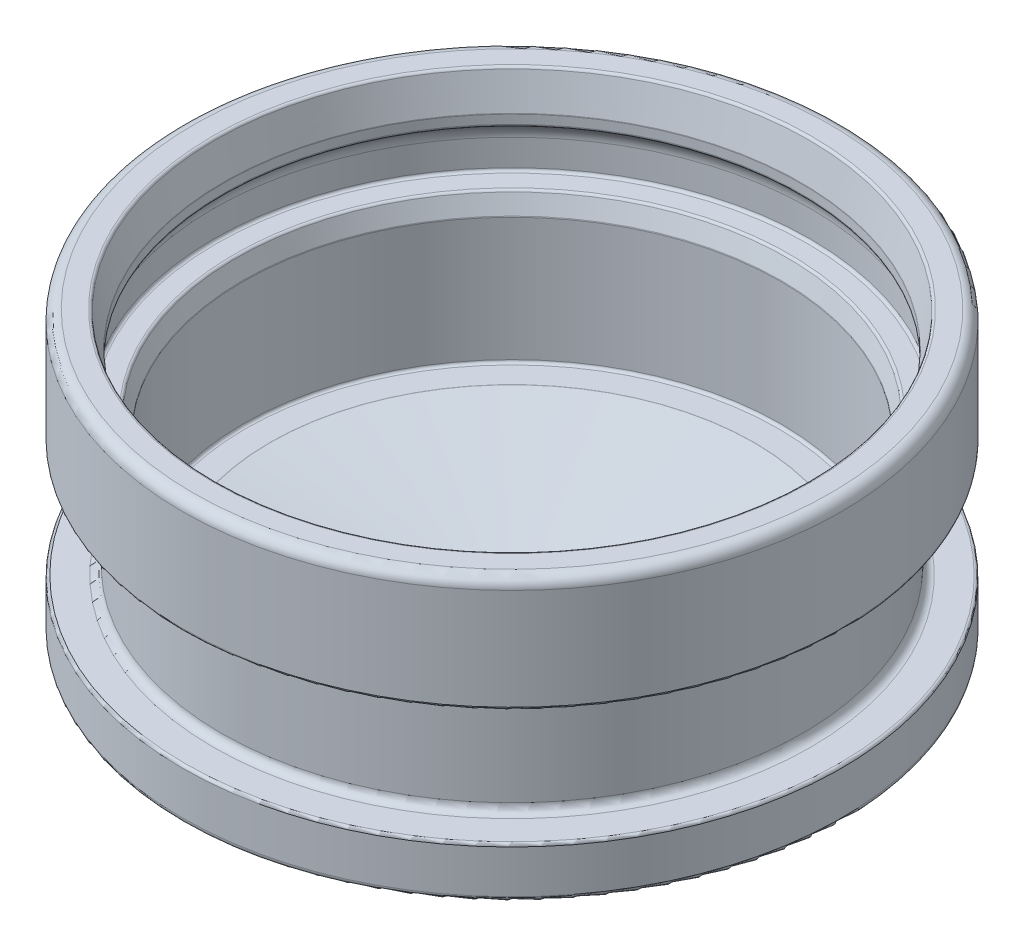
ISO-10303-21;
HEADER;
FILE_DESCRIPTION(('STEP AP214'),'2;1');
FILE_NAME('part.step','',(''),(''),'','','');
FILE_SCHEMA(('AUTOMOTIVE_DESIGN { 1 0 10303 214 1 1 1 1 }'));
ENDSEC;
DATA;
#1=APPLICATION_CONTEXT('core data for automotive mechanical design processes');
#2=APPLICATION_PROTOCOL_DEFINITION('international standard','automotive_design',2000,#1);
#3=PRODUCT_CONTEXT('',#1,'mechanical');
#4=PRODUCT('Part','Part','',(#3));
#5=PRODUCT_RELATED_PRODUCT_CATEGORY('part','',(#4));
#6=PRODUCT_DEFINITION_FORMATION('','',#4);
#7=PRODUCT_DEFINITION_CONTEXT('part definition',#1,'design');
#8=PRODUCT_DEFINITION('design','',#6,#7);
#9=PRODUCT_DEFINITION_SHAPE('','',#8);
#10=(LENGTH_UNIT() NAMED_UNIT(*) SI_UNIT(.MILLI.,.METRE.));
#11=(NAMED_UNIT(*) PLANE_ANGLE_UNIT() SI_UNIT($,.RADIAN.));
#12=(NAMED_UNIT(*) SI_UNIT($,.STERADIAN.) SOLID_ANGLE_UNIT());
#13=UNCERTAINTY_MEASURE_WITH_UNIT(LENGTH_MEASURE(1.E-05),#10,'distance_accuracy_value','');
#14=(GEOMETRIC_REPRESENTATION_CONTEXT(3) GLOBAL_UNCERTAINTY_ASSIGNED_CONTEXT((#13)) GLOBAL_UNIT_ASSIGNED_CONTEXT((#10,
#11,#12)) REPRESENTATION_CONTEXT('',''));
#15=CARTESIAN_POINT('',(0.,0.,0.));
#16=DIRECTION('',(0.,0.,1.));
#17=DIRECTION('',(1.,0.,0.));
#18=AXIS2_PLACEMENT_3D('',#15,#16,#17);
#19=CARTESIAN_POINT('',(0.,-0.508000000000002,0.));
#20=DIRECTION('',(0.,1.,0.));
#21=DIRECTION('',(0.,0.,1.00000000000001));
#22=AXIS2_PLACEMENT_3D('',#19,#20,#21);
#23=TOROIDAL_SURFACE('',#22,15.0495,0.508);
#24=CARTESIAN_POINT('',(0.,-0.508000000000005,0.));
#25=DIRECTION('',(0.,1.,0.));
#26=DIRECTION('',(0.,0.,1.00000000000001));
#27=AXIS2_PLACEMENT_3D('',#24,#25,#26);
#28=CIRCLE('',#27,15.5575);
#29=CARTESIAN_POINT('',(0.,-0.508000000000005,15.5575000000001));
#30=VERTEX_POINT('',#29);
#31=EDGE_CURVE('E10',#30,#30,#28,.T.);
#32=ORIENTED_EDGE('',*,*,#31,.T.);
#33=EDGE_LOOP('',(#32));
#34=FACE_BOUND('',#33,.T.);
#35=CARTESIAN_POINT('',(0.,0.,0.));
#36=DIRECTION('',(0.,1.,0.));
#37=DIRECTION('',(0.,0.,1.00000000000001));
#38=AXIS2_PLACEMENT_3D('',#35,#36,#37);
#39=CIRCLE('',#38,15.0495);
#40=CARTESIAN_POINT('',(0.,0.,15.0495000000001));
#41=VERTEX_POINT('',#40);
#42=EDGE_CURVE('E135',#41,#41,#39,.T.);
#43=ORIENTED_EDGE('',*,*,#42,.F.);
#44=EDGE_LOOP('',(#43));
#45=FACE_BOUND('',#44,.T.);
#46=ADVANCED_FACE('F32',(#34,#45),#23,.T.);
#47=CARTESIAN_POINT('',(0.,0.,0.));
#48=DIRECTION('',(0.,1.,0.));
#49=DIRECTION('',(0.,0.,1.00000000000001));
#50=AXIS2_PLACEMENT_3D('',#47,#48,#49);
#51=CYLINDRICAL_SURFACE('',#50,15.5575);
#52=CARTESIAN_POINT('',(0.,-5.2832,0.));
#53=DIRECTION('',(0.,1.,0.));
#54=DIRECTION('',(0.,0.,1.00000000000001));
#55=AXIS2_PLACEMENT_3D('',#52,#53,#54);
#56=CIRCLE('',#55,15.5575);
#57=CARTESIAN_POINT('',(0.,-5.2832,15.5575000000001));
#58=VERTEX_POINT('',#57);
#59=EDGE_CURVE('E38',#58,#58,#56,.T.);
#60=ORIENTED_EDGE('',*,*,#59,.T.);
#61=EDGE_LOOP('',(#60));
#62=FACE_BOUND('',#61,.T.);
#63=ORIENTED_EDGE('',*,*,#31,.F.);
#64=EDGE_LOOP('',(#63));
#65=FACE_BOUND('',#64,.T.);
#66=ADVANCED_FACE('F143',(#62,#65),#51,.T.);
#67=CARTESIAN_POINT('',(0.,-5.2832,0.));
#68=DIRECTION('',(0.,1.,0.));
#69=DIRECTION('',(0.,0.,1.00000000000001));
#70=AXIS2_PLACEMENT_3D('',#67,#68,#69);
#71=TOROIDAL_SURFACE('',#70,15.4305,0.127);
#72=CARTESIAN_POINT('',(0.,-5.4102,0.));
#73=DIRECTION('',(0.,1.,0.));
#74=DIRECTION('',(0.,0.,1.00000000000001));
#75=AXIS2_PLACEMENT_3D('',#72,#73,#74);
#76=CIRCLE('',#75,15.4305);
#77=CARTESIAN_POINT('',(0.,-5.4102,15.4305000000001));
#78=VERTEX_POINT('',#77);
#79=EDGE_CURVE('E42',#78,#78,#76,.T.);
#80=ORIENTED_EDGE('',*,*,#79,.T.);
#81=EDGE_LOOP('',(#80));
#82=FACE_BOUND('',#81,.T.);
#83=ORIENTED_EDGE('',*,*,#59,.F.);
#84=EDGE_LOOP('',(#83));
#85=FACE_BOUND('',#84,.T.);
#86=ADVANCED_FACE('F147',(#82,#85),#71,.T.);
#87=CARTESIAN_POINT('',(-15.4305000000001,-5.4102,0.));
#88=DIRECTION('',(0.,-1.,0.));
#89=DIRECTION('',(0.,0.,-1.00000000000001));
#90=AXIS2_PLACEMENT_3D('',#87,#88,#89);
#91=PLANE('',#90);
#92=CARTESIAN_POINT('',(0.,-5.4102,0.));
#93=DIRECTION('',(0.,1.,0.));
#94=DIRECTION('',(0.,0.,1.00000000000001));
#95=AXIS2_PLACEMENT_3D('',#92,#93,#94);
#96=CIRCLE('',#95,14.097);
#97=CARTESIAN_POINT('',(0.,-5.4102,14.0970000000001));
#98=VERTEX_POINT('',#97);
#99=EDGE_CURVE('E46',#98,#98,#96,.T.);
#100=ORIENTED_EDGE('',*,*,#99,.T.);
#101=EDGE_LOOP('',(#100));
#102=FACE_BOUND('',#101,.T.);
#103=ORIENTED_EDGE('',*,*,#79,.F.);
#104=EDGE_LOOP('',(#103));
#105=FACE_BOUND('',#104,.T.);
#106=ADVANCED_FACE('F151',(#102,#105),#91,.T.);
#107=CARTESIAN_POINT('',(0.,-5.7912,0.));
#108=DIRECTION('',(0.,1.,0.));
#109=DIRECTION('',(0.,0.,1.00000000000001));
#110=AXIS2_PLACEMENT_3D('',#107,#108,#109);
#111=TOROIDAL_SURFACE('',#110,14.097,0.381);
#112=CARTESIAN_POINT('',(0.,-5.7912,0.));
#113=DIRECTION('',(0.,1.,0.));
#114=DIRECTION('',(0.,0.,1.00000000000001));
#115=AXIS2_PLACEMENT_3D('',#112,#113,#114);
#116=CIRCLE('',#115,13.716);
#117=CARTESIAN_POINT('',(0.,-5.7912,13.7160000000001));
#118=VERTEX_POINT('',#117);
#119=EDGE_CURVE('E51',#118,#118,#116,.T.);
#120=ORIENTED_EDGE('',*,*,#119,.T.);
#121=EDGE_LOOP('',(#120));
#122=FACE_BOUND('',#121,.T.);
#123=ORIENTED_EDGE('',*,*,#99,.F.);
#124=EDGE_LOOP('',(#123));
#125=FACE_BOUND('',#124,.T.);
#126=ADVANCED_FACE('F158',(#122,#125),#111,.F.);
#127=CARTESIAN_POINT('',(0.,0.,0.));
#128=DIRECTION('',(0.,1.,0.));
#129=DIRECTION('',(0.,0.,1.00000000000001));
#130=AXIS2_PLACEMENT_3D('',#127,#128,#129);
#131=CYLINDRICAL_SURFACE('',#130,13.716);
#132=CARTESIAN_POINT('',(0.,-10.4902,0.));
#133=DIRECTION('',(0.,1.,0.));
#134=DIRECTION('',(0.,0.,1.00000000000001));
#135=AXIS2_PLACEMENT_3D('',#132,#133,#134);
#136=CIRCLE('',#135,13.716);
#137=CARTESIAN_POINT('',(0.,-10.4902,13.7160000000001));
#138=VERTEX_POINT('',#137);
#139=EDGE_CURVE('E54',#138,#138,#136,.T.);
#140=ORIENTED_EDGE('',*,*,#139,.T.);
#141=EDGE_LOOP('',(#140));
#142=FACE_BOUND('',#141,.T.);
#143=ORIENTED_EDGE('',*,*,#119,.F.);
#144=EDGE_LOOP('',(#143));
#145=FACE_BOUND('',#144,.T.);
#146=ADVANCED_FACE('F162',(#142,#145),#131,.T.);
#147=CARTESIAN_POINT('',(0.,-10.4902,0.));
#148=DIRECTION('',(0.,1.,0.));
#149=DIRECTION('',(0.,0.,1.00000000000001));
#150=AXIS2_PLACEMENT_3D('',#147,#148,#149);
#151=TOROIDAL_SURFACE('',#150,14.097,0.380999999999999);
#152=CARTESIAN_POINT('',(0.,-10.8712,0.));
#153=DIRECTION('',(0.,1.,0.));
#154=DIRECTION('',(0.,0.,1.00000000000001));
#155=AXIS2_PLACEMENT_3D('',#152,#153,#154);
#156=CIRCLE('',#155,14.097);
#157=CARTESIAN_POINT('',(0.,-10.8712,14.0970000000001));
#158=VERTEX_POINT('',#157);
#159=EDGE_CURVE('E57',#158,#158,#156,.T.);
#160=ORIENTED_EDGE('',*,*,#159,.T.);
#161=EDGE_LOOP('',(#160));
#162=FACE_BOUND('',#161,.T.);
#163=ORIENTED_EDGE('',*,*,#139,.F.);
#164=EDGE_LOOP('',(#163));
#165=FACE_BOUND('',#164,.T.);
#166=ADVANCED_FACE('F166',(#162,#165),#151,.F.);
#167=CARTESIAN_POINT('',(-14.0970000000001,-10.8712,0.));
#168=DIRECTION('',(0.,1.,0.));
#169=DIRECTION('',(0.,0.,1.00000000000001));
#170=AXIS2_PLACEMENT_3D('',#167,#168,#169);
#171=PLANE('',#170);
#172=CARTESIAN_POINT('',(0.,-10.8712,0.));
#173=DIRECTION('',(0.,1.,0.));
#174=DIRECTION('',(0.,0.,1.00000000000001));
#175=AXIS2_PLACEMENT_3D('',#172,#173,#174);
#176=CIRCLE('',#175,15.4305);
#177=CARTESIAN_POINT('',(0.,-10.8712,15.4305000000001));
#178=VERTEX_POINT('',#177);
#179=EDGE_CURVE('E60',#178,#178,#176,.T.);
#180=ORIENTED_EDGE('',*,*,#179,.T.);
#181=EDGE_LOOP('',(#180));
#182=FACE_BOUND('',#181,.T.);
#183=ORIENTED_EDGE('',*,*,#159,.F.);
#184=EDGE_LOOP('',(#183));
#185=FACE_BOUND('',#184,.T.);
#186=ADVANCED_FACE('F170',(#182,#185),#171,.T.);
#187=CARTESIAN_POINT('',(0.,-10.9982,0.));
#188=DIRECTION('',(0.,1.,0.));
#189=DIRECTION('',(0.,0.,1.00000000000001));
#190=AXIS2_PLACEMENT_3D('',#187,#188,#189);
#191=TOROIDAL_SURFACE('',#190,15.4305,0.127000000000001);
#192=CARTESIAN_POINT('',(0.,-10.9982,0.));
#193=DIRECTION('',(0.,1.,0.));
#194=DIRECTION('',(0.,0.,1.00000000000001));
#195=AXIS2_PLACEMENT_3D('',#192,#193,#194);
#196=CIRCLE('',#195,15.5575);
#197=CARTESIAN_POINT('',(0.,-10.9982,15.5575000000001));
#198=VERTEX_POINT('',#197);
#199=EDGE_CURVE('E63',#198,#198,#196,.T.);
#200=ORIENTED_EDGE('',*,*,#199,.T.);
#201=EDGE_LOOP('',(#200));
#202=FACE_BOUND('',#201,.T.);
#203=ORIENTED_EDGE('',*,*,#179,.F.);
#204=EDGE_LOOP('',(#203));
#205=FACE_BOUND('',#204,.T.);
#206=ADVANCED_FACE('F174',(#202,#205),#191,.T.);
#207=CARTESIAN_POINT('',(0.,0.,0.));
#208=DIRECTION('',(0.,1.,0.));
#209=DIRECTION('',(0.,0.,1.00000000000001));
#210=AXIS2_PLACEMENT_3D('',#207,#208,#209);
#211=CYLINDRICAL_SURFACE('',#210,15.5575);
#212=CARTESIAN_POINT('',(0.,-13.0302,0.));
#213=DIRECTION('',(0.,1.,0.));
#214=DIRECTION('',(0.,0.,1.00000000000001));
#215=AXIS2_PLACEMENT_3D('',#212,#213,#214);
#216=CIRCLE('',#215,15.5575);
#217=CARTESIAN_POINT('',(0.,-13.0302,15.5575000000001));
#218=VERTEX_POINT('',#217);
#219=EDGE_CURVE('E66',#218,#218,#216,.T.);
#220=ORIENTED_EDGE('',*,*,#219,.T.);
#221=EDGE_LOOP('',(#220));
#222=FACE_BOUND('',#221,.T.);
#223=ORIENTED_EDGE('',*,*,#199,.F.);
#224=EDGE_LOOP('',(#223));
#225=FACE_BOUND('',#224,.T.);
#226=ADVANCED_FACE('F178',(#222,#225),#211,.T.);
#227=CARTESIAN_POINT('',(0.,-13.0302,0.));
#228=DIRECTION('',(0.,1.,0.));
#229=DIRECTION('',(0.,0.,1.00000000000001));
#230=AXIS2_PLACEMENT_3D('',#227,#228,#229);
#231=TOROIDAL_SURFACE('',#230,15.3035,0.254000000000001);
#232=CARTESIAN_POINT('',(0.,-13.2842,0.));
#233=DIRECTION('',(0.,1.,0.));
#234=DIRECTION('',(0.,0.,1.00000000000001));
#235=AXIS2_PLACEMENT_3D('',#232,#233,#234);
#236=CIRCLE('',#235,15.3035);
#237=CARTESIAN_POINT('',(0.,-13.2842,15.3035000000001));
#238=VERTEX_POINT('',#237);
#239=EDGE_CURVE('E69',#238,#238,#236,.T.);
#240=ORIENTED_EDGE('',*,*,#239,.T.);
#241=EDGE_LOOP('',(#240));
#242=FACE_BOUND('',#241,.T.);
#243=ORIENTED_EDGE('',*,*,#219,.F.);
#244=EDGE_LOOP('',(#243));
#245=FACE_BOUND('',#244,.T.);
#246=ADVANCED_FACE('F182',(#242,#245),#231,.T.);
#247=CARTESIAN_POINT('',(-15.3035000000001,-13.2842,0.));
#248=DIRECTION('',(0.,-1.,0.));
#249=DIRECTION('',(0.,0.,-1.00000000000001));
#250=AXIS2_PLACEMENT_3D('',#247,#248,#249);
#251=PLANE('',#250);
#252=CARTESIAN_POINT('',(0.,-13.2842,0.));
#253=DIRECTION('',(0.,1.,0.));
#254=DIRECTION('',(0.,0.,1.00000000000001));
#255=AXIS2_PLACEMENT_3D('',#252,#253,#254);
#256=CIRCLE('',#255,1.8034);
#257=CARTESIAN_POINT('',(0.,-13.2842,1.80340000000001));
#258=VERTEX_POINT('',#257);
#259=EDGE_CURVE('E72',#258,#258,#256,.T.);
#260=ORIENTED_EDGE('',*,*,#259,.T.);
#261=EDGE_LOOP('',(#260));
#262=FACE_BOUND('',#261,.T.);
#263=ORIENTED_EDGE('',*,*,#239,.F.);
#264=EDGE_LOOP('',(#263));
#265=FACE_BOUND('',#264,.T.);
#266=ADVANCED_FACE('F186',(#262,#265),#251,.T.);
#267=CARTESIAN_POINT('',(0.,-13.208,0.));
#268=DIRECTION('',(0.,1.,0.));
#269=DIRECTION('',(0.,0.,1.00000000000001));
#270=AXIS2_PLACEMENT_3D('',#267,#268,#269);
#271=TOROIDAL_SURFACE('',#270,1.8034,0.0762000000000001);
#272=CARTESIAN_POINT('',(0.,-13.208,0.));
#273=DIRECTION('',(0.,1.,0.));
#274=DIRECTION('',(0.,0.,1.00000000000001));
#275=AXIS2_PLACEMENT_3D('',#272,#273,#274);
#276=CIRCLE('',#275,1.7272);
#277=CARTESIAN_POINT('',(0.,-13.208,1.72720000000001));
#278=VERTEX_POINT('',#277);
#279=EDGE_CURVE('E75',#278,#278,#276,.T.);
#280=ORIENTED_EDGE('',*,*,#279,.T.);
#281=EDGE_LOOP('',(#280));
#282=FACE_BOUND('',#281,.T.);
#283=ORIENTED_EDGE('',*,*,#259,.F.);
#284=EDGE_LOOP('',(#283));
#285=FACE_BOUND('',#284,.T.);
#286=ADVANCED_FACE('F190',(#282,#285),#271,.T.);
#287=CARTESIAN_POINT('',(0.,0.,0.));
#288=DIRECTION('',(0.,1.,0.));
#289=DIRECTION('',(0.,0.,1.00000000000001));
#290=AXIS2_PLACEMENT_3D('',#287,#288,#289);
#291=CYLINDRICAL_SURFACE('',#290,1.7272);
#292=CARTESIAN_POINT('',(0.,-12.9670334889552,0.));
#293=DIRECTION('',(0.,1.,0.));
#294=DIRECTION('',(0.,0.,1.00000000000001));
#295=AXIS2_PLACEMENT_3D('',#292,#293,#294);
#296=CIRCLE('',#295,1.7272);
#297=CARTESIAN_POINT('',(0.,-12.9670334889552,1.72720000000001));
#298=VERTEX_POINT('',#297);
#299=EDGE_CURVE('E78',#298,#298,#296,.T.);
#300=ORIENTED_EDGE('',*,*,#299,.T.);
#301=EDGE_LOOP('',(#300));
#302=FACE_BOUND('',#301,.T.);
#303=ORIENTED_EDGE('',*,*,#279,.F.);
#304=EDGE_LOOP('',(#303));
#305=FACE_BOUND('',#304,.T.);
#306=ADVANCED_FACE('F194',(#302,#305),#291,.F.);
#307=CARTESIAN_POINT('',(0.,-12.9670334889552,0.));
#308=DIRECTION('',(0.,1.,0.));
#309=DIRECTION('',(0.,0.,1.00000000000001));
#310=AXIS2_PLACEMENT_3D('',#307,#308,#309);
#311=TOROIDAL_SURFACE('',#310,1.8034,0.0761999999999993);
#312=CARTESIAN_POINT('',(0.,-12.8920128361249,0.));
#313=DIRECTION('',(0.,1.,0.));
#314=DIRECTION('',(0.,0.,1.00000000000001));
#315=AXIS2_PLACEMENT_3D('',#312,#313,#314);
#316=CIRCLE('',#315,1.79004553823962);
#317=CARTESIAN_POINT('',(0.,-12.8920128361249,1.79004553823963));
#318=VERTEX_POINT('',#317);
#319=EDGE_CURVE('E81',#318,#318,#316,.T.);
#320=ORIENTED_EDGE('',*,*,#319,.T.);
#321=EDGE_LOOP('',(#320));
#322=FACE_BOUND('',#321,.T.);
#323=ORIENTED_EDGE('',*,*,#299,.F.);
#324=EDGE_LOOP('',(#323));
#325=FACE_BOUND('',#324,.T.);
#326=ADVANCED_FACE('F198',(#322,#325),#311,.T.);
#327=CARTESIAN_POINT('',(0.,-12.8920128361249,0.));
#328=DIRECTION('',(0.,1.,0.));
#329=DIRECTION('',(0.,0.,1.00000000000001));
#330=AXIS2_PLACEMENT_3D('',#327,#328,#329);
#331=CONICAL_SURFACE('',#330,1.79004553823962,1.39463114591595);
#332=CARTESIAN_POINT('',(0.,-11.1771793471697,0.));
#333=DIRECTION('',(0.,1.,0.));
#334=DIRECTION('',(0.,0.,1.00000000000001));
#335=AXIS2_PLACEMENT_3D('',#332,#333,#334);
#336=CIRCLE('',#335,11.423374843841);
#337=CARTESIAN_POINT('',(0.,-11.1771793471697,11.4233748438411));
#338=VERTEX_POINT('',#337);
#339=EDGE_CURVE('E84',#338,#338,#336,.T.);
#340=CARTESIAN_POINT('',(0.,-11.1771793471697,11.4233748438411));
#341=CARTESIAN_POINT('',(0.,-11.1950421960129,11.3230276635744));
#342=CARTESIAN_POINT('',(0.,-11.2129050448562,11.2226804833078));
#343=CARTESIAN_POINT('',(0.,-11.2486307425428,11.0219861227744));
#344=CARTESIAN_POINT('',(0.,-11.2664935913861,10.9216389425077));
#345=CARTESIAN_POINT('',(0.,-11.3022192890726,10.7209445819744));
#346=CARTESIAN_POINT('',(0.,-11.3200821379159,10.6205974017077));
#347=CARTESIAN_POINT('',(0.,-11.3558078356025,10.4199030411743));
#348=CARTESIAN_POINT('',(0.,-11.3736706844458,10.3195558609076));
#349=CARTESIAN_POINT('',(0.,-11.4093963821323,10.1188615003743));
#350=CARTESIAN_POINT('',(0.,-11.4272592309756,10.0185143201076));
#351=CARTESIAN_POINT('',(0.,-11.4629849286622,9.81781995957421));
#352=CARTESIAN_POINT('',(0.,-11.4808477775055,9.71747277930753));
#353=CARTESIAN_POINT('',(0.,-11.516573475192,9.51677841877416));
#354=CARTESIAN_POINT('',(0.,-11.5344363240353,9.41643123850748));
#355=CARTESIAN_POINT('',(0.,-11.5701620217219,9.21573687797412));
#356=CARTESIAN_POINT('',(0.,-11.5880248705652,9.11538969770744));
#357=CARTESIAN_POINT('',(0.,-11.6237505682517,8.91469533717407));
#358=CARTESIAN_POINT('',(0.,-11.641613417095,8.81434815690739));
#359=CARTESIAN_POINT('',(0.,-11.6773391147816,8.61365379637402));
#360=CARTESIAN_POINT('',(0.,-11.6952019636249,8.51330661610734));
#361=CARTESIAN_POINT('',(0.,-11.7309276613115,8.31261225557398));
#362=CARTESIAN_POINT('',(0.,-11.7487905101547,8.21226507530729));
#363=CARTESIAN_POINT('',(0.,-11.7845162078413,8.01157071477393));
#364=CARTESIAN_POINT('',(0.,-11.8023790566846,7.91122353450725));
#365=CARTESIAN_POINT('',(0.,-11.8381047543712,7.71052917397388));
#366=CARTESIAN_POINT('',(0.,-11.8559676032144,7.6101819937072));
#367=CARTESIAN_POINT('',(0.,-11.891693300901,7.40948763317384));
#368=CARTESIAN_POINT('',(0.,-11.9095561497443,7.30914045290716));
#369=CARTESIAN_POINT('',(0.,-11.9452818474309,7.10844609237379));
#370=CARTESIAN_POINT('',(0.,-11.9631446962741,7.00809891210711));
#371=CARTESIAN_POINT('',(0.,-11.9988703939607,6.80740455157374));
#372=CARTESIAN_POINT('',(0.,-12.016733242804,6.70705737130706));
#373=CARTESIAN_POINT('',(0.,-12.0524589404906,6.5063630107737));
#374=CARTESIAN_POINT('',(0.,-12.0703217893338,6.40601583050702));
#375=CARTESIAN_POINT('',(0.,-12.1060474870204,6.20532146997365));
#376=CARTESIAN_POINT('',(0.,-12.1239103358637,6.10497428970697));
#377=CARTESIAN_POINT('',(0.,-12.1596360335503,5.9042799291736));
#378=CARTESIAN_POINT('',(0.,-12.1774988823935,5.80393274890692));
#379=CARTESIAN_POINT('',(0.,-12.2132245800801,5.60323838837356));
#380=CARTESIAN_POINT('',(0.,-12.2310874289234,5.50289120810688));
#381=CARTESIAN_POINT('',(0.,-12.26681312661,5.30219684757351));
#382=CARTESIAN_POINT('',(0.,-12.2846759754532,5.20184966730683));
#383=CARTESIAN_POINT('',(0.,-12.3204016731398,5.00115530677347));
#384=CARTESIAN_POINT('',(0.,-12.3382645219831,4.90080812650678));
#385=CARTESIAN_POINT('',(0.,-12.3739902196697,4.70011376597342));
#386=CARTESIAN_POINT('',(0.,-12.3918530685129,4.59976658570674));
#387=CARTESIAN_POINT('',(0.,-12.4275787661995,4.39907222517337));
#388=CARTESIAN_POINT('',(0.,-12.4454416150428,4.29872504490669));
#389=CARTESIAN_POINT('',(0.,-12.4811673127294,4.09803068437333));
#390=CARTESIAN_POINT('',(0.,-12.4990301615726,3.99768350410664));
#391=CARTESIAN_POINT('',(0.,-12.5347558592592,3.79698914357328));
#392=CARTESIAN_POINT('',(0.,-12.5526187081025,3.6966419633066));
#393=CARTESIAN_POINT('',(0.,-12.5883444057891,3.49594760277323));
#394=CARTESIAN_POINT('',(0.,-12.6062072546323,3.39560042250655));
#395=CARTESIAN_POINT('',(0.,-12.6419329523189,3.19490606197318));
#396=CARTESIAN_POINT('',(0.,-12.6597958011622,3.0945588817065));
#397=CARTESIAN_POINT('',(0.,-12.6955214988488,2.89386452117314));
#398=CARTESIAN_POINT('',(0.,-12.713384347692,2.79351734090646));
#399=CARTESIAN_POINT('',(0.,-12.7491100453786,2.59282298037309));
#400=CARTESIAN_POINT('',(0.,-12.7669728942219,2.49247580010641));
#401=CARTESIAN_POINT('',(0.,-12.8026985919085,2.29178143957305));
#402=CARTESIAN_POINT('',(0.,-12.8205614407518,2.19143425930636));
#403=CARTESIAN_POINT('',(0.,-12.8562871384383,1.990739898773));
#404=CARTESIAN_POINT('',(0.,-12.8741499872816,1.89039271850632));
#405=CARTESIAN_POINT('',(0.,-12.8920128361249,1.79004553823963));
#406=B_SPLINE_CURVE_WITH_KNOTS('',3,(#340,#341,#342,#343,#344,#345,#346,#347,#348,#349,#350,
#351,#352,#353,#354,#355,#356,#357,#358,#359,#360,#361,#362,#363,#364,#365,#366,#367,#368,#369,
#370,#371,#372,#373,#374,#375,#376,#377,#378,#379,#380,#381,#382,#383,#384,#385,#386,#387,#388,
#389,#390,#391,#392,#393,#394,#395,#396,#397,#398,#399,#400,#401,#402,#403,#404,#405),
.UNSPECIFIED.,.F.,.F.,(4,2,2,2,2,2,2,2,2,2,2,2,2,2,2,2,2,2,2,2,2,2,2,2,2,2,2,2,2,2,2,2,4),(0.,
0.305774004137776,0.611548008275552,0.917322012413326,1.2230960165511,1.52887002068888,
1.83464402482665,2.14041802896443,2.4461920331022,2.75196603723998,3.05774004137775,
3.36351404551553,3.6692880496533,3.97506205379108,4.28083605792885,4.58661006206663,
4.8923840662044,5.19815807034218,5.50393207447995,5.80970607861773,6.1154800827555,
6.42125408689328,6.72702809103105,7.03280209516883,7.33857609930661,7.64435010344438,
7.95012410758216,8.25589811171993,8.56167211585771,8.86744611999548,9.17322012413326,
9.47899412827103,9.78476813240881),.UNSPECIFIED.);
#407=EDGE_CURVE('BSEAM202',#338,#318,#406,.T.);
#408=ORIENTED_EDGE('',*,*,#339,.T.);
#409=ORIENTED_EDGE('',*,*,#319,.F.);
#410=ORIENTED_EDGE('',*,*,#407,.T.);
#411=ORIENTED_EDGE('',*,*,#407,.F.);
#412=EDGE_LOOP('',(#408,#410,#409,#411));
#413=FACE_BOUND('',#412,.T.);
#414=ADVANCED_FACE('F202',(#413),#331,.F.);
#415=CARTESIAN_POINT('',(0.,-11.2522,0.));
#416=DIRECTION('',(0.,1.,0.));
#417=DIRECTION('',(0.,0.,1.00000000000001));
#418=AXIS2_PLACEMENT_3D('',#415,#416,#417);
#419=TOROIDAL_SURFACE('',#418,11.4367293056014,0.0762000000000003);
#420=CARTESIAN_POINT('',(0.,-11.176,0.));
#421=DIRECTION('',(0.,1.,0.));
#422=DIRECTION('',(0.,0.,1.00000000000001));
#423=AXIS2_PLACEMENT_3D('',#420,#421,#422);
#424=CIRCLE('',#423,11.4367293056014);
#425=CARTESIAN_POINT('',(0.,-11.176,11.4367293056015));
#426=VERTEX_POINT('',#425);
#427=EDGE_CURVE('E87',#426,#426,#424,.T.);
#428=ORIENTED_EDGE('',*,*,#427,.T.);
#429=EDGE_LOOP('',(#428));
#430=FACE_BOUND('',#429,.T.);
#431=ORIENTED_EDGE('',*,*,#339,.F.);
#432=EDGE_LOOP('',(#431));
#433=FACE_BOUND('',#432,.T.);
#434=ADVANCED_FACE('F206',(#430,#433),#419,.T.);
#435=CARTESIAN_POINT('',(-11.4367293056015,-11.176,0.));
#436=DIRECTION('',(0.,1.,0.));
#437=DIRECTION('',(0.,0.,1.00000000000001));
#438=AXIS2_PLACEMENT_3D('',#435,#436,#437);
#439=PLANE('',#438);
#440=CARTESIAN_POINT('',(0.,-11.176,0.));
#441=DIRECTION('',(0.,1.,0.));
#442=DIRECTION('',(0.,0.,1.00000000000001));
#443=AXIS2_PLACEMENT_3D('',#440,#441,#442);
#444=CIRCLE('',#443,12.573);
#445=CARTESIAN_POINT('',(0.,-11.176,12.5730000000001));
#446=VERTEX_POINT('',#445);
#447=EDGE_CURVE('E90',#446,#446,#444,.T.);
#448=ORIENTED_EDGE('',*,*,#447,.T.);
#449=EDGE_LOOP('',(#448));
#450=FACE_BOUND('',#449,.T.);
#451=ORIENTED_EDGE('',*,*,#427,.F.);
#452=EDGE_LOOP('',(#451));
#453=FACE_BOUND('',#452,.T.);
#454=ADVANCED_FACE('F210',(#450,#453),#439,.T.);
#455=CARTESIAN_POINT('',(0.,-11.049,0.));
#456=DIRECTION('',(0.,1.,0.));
#457=DIRECTION('',(0.,0.,1.00000000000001));
#458=AXIS2_PLACEMENT_3D('',#455,#456,#457);
#459=TOROIDAL_SURFACE('',#458,12.573,0.127);
#460=CARTESIAN_POINT('',(0.,-11.049,0.));
#461=DIRECTION('',(0.,1.,0.));
#462=DIRECTION('',(0.,0.,1.00000000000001));
#463=AXIS2_PLACEMENT_3D('',#460,#461,#462);
#464=CIRCLE('',#463,12.7);
#465=CARTESIAN_POINT('',(0.,-11.049,12.7000000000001));
#466=VERTEX_POINT('',#465);
#467=EDGE_CURVE('E93',#466,#466,#464,.T.);
#468=ORIENTED_EDGE('',*,*,#467,.T.);
#469=EDGE_LOOP('',(#468));
#470=FACE_BOUND('',#469,.T.);
#471=ORIENTED_EDGE('',*,*,#447,.F.);
#472=EDGE_LOOP('',(#471));
#473=FACE_BOUND('',#472,.T.);
#474=ADVANCED_FACE('F214',(#470,#473),#459,.F.);
#475=CARTESIAN_POINT('',(0.,0.,0.));
#476=DIRECTION('',(0.,1.,0.));
#477=DIRECTION('',(0.,0.,1.00000000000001));
#478=AXIS2_PLACEMENT_3D('',#475,#476,#477);
#479=CYLINDRICAL_SURFACE('',#478,12.7);
#480=CARTESIAN_POINT('',(0.,-5.22939352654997,0.));
#481=DIRECTION('',(0.,1.,0.));
#482=DIRECTION('',(0.,0.,1.00000000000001));
#483=AXIS2_PLACEMENT_3D('',#480,#481,#482);
#484=CIRCLE('',#483,12.7);
#485=CARTESIAN_POINT('',(0.,-5.22939352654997,12.7000000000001));
#486=VERTEX_POINT('',#485);
#487=EDGE_CURVE('E96',#486,#486,#484,.T.);
#488=ORIENTED_EDGE('',*,*,#487,.T.);
#489=EDGE_LOOP('',(#488));
#490=FACE_BOUND('',#489,.T.);
#491=ORIENTED_EDGE('',*,*,#467,.F.);
#492=EDGE_LOOP('',(#491));
#493=FACE_BOUND('',#492,.T.);
#494=ADVANCED_FACE('F218',(#490,#493),#479,.F.);
#495=CARTESIAN_POINT('',(0.,-5.22939352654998,0.));
#496=DIRECTION('',(0.,1.,0.));
#497=DIRECTION('',(0.,0.,1.00000000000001));
#498=AXIS2_PLACEMENT_3D('',#495,#496,#497);
#499=TOROIDAL_SURFACE('',#498,12.827,0.127);
#500=CARTESIAN_POINT('',(0.,-5.18595696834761,0.));
#501=DIRECTION('',(0.,1.,0.));
#502=DIRECTION('',(0.,0.,1.00000000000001));
#503=AXIS2_PLACEMENT_3D('',#500,#501,#502);
#504=CIRCLE('',#503,12.7076590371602);
#505=CARTESIAN_POINT('',(0.,-5.18595696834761,12.7076590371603));
#506=VERTEX_POINT('',#505);
#507=EDGE_CURVE('E99',#506,#506,#504,.T.);
#508=ORIENTED_EDGE('',*,*,#507,.T.);
#509=EDGE_LOOP('',(#508));
#510=FACE_BOUND('',#509,.T.);
#511=ORIENTED_EDGE('',*,*,#487,.F.);
#512=EDGE_LOOP('',(#511));
#513=FACE_BOUND('',#512,.T.);
#514=ADVANCED_FACE('F222',(#510,#513),#499,.T.);
#515=CARTESIAN_POINT('',(0.,-5.18595696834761,0.));
#516=DIRECTION('',(0.,1.,0.));
#517=DIRECTION('',(0.,0.,1.00000000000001));
#518=AXIS2_PLACEMENT_3D('',#515,#516,#517);
#519=CONICAL_SURFACE('',#518,12.7076590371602,0.34906585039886);
#520=CARTESIAN_POINT('',(0.,-4.40156344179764,0.));
#521=DIRECTION('',(0.,1.,0.));
#522=DIRECTION('',(0.,0.,1.00000000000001));
#523=AXIS2_PLACEMENT_3D('',#520,#521,#522);
#524=CIRCLE('',#523,12.9931549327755);
#525=CARTESIAN_POINT('',(0.,-4.40156344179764,12.9931549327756));
#526=VERTEX_POINT('',#525);
#527=EDGE_CURVE('E102',#526,#526,#524,.T.);
#528=ORIENTED_EDGE('',*,*,#527,.T.);
#529=EDGE_LOOP('',(#528));
#530=FACE_BOUND('',#529,.T.);
#531=ORIENTED_EDGE('',*,*,#507,.F.);
#532=EDGE_LOOP('',(#531));
#533=FACE_BOUND('',#532,.T.);
#534=ADVANCED_FACE('F226',(#530,#533),#519,.F.);
#535=CARTESIAN_POINT('',(0.,-4.445,0.));
#536=DIRECTION('',(0.,1.,0.));
#537=DIRECTION('',(0.,0.,1.00000000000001));
#538=AXIS2_PLACEMENT_3D('',#535,#536,#537);
#539=TOROIDAL_SURFACE('',#538,13.1124958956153,0.127);
#540=CARTESIAN_POINT('',(0.,-4.318,0.));
#541=DIRECTION('',(0.,1.,0.));
#542=DIRECTION('',(0.,0.,1.00000000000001));
#543=AXIS2_PLACEMENT_3D('',#540,#541,#542);
#544=CIRCLE('',#543,13.1124958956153);
#545=CARTESIAN_POINT('',(0.,-4.318,13.1124958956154));
#546=VERTEX_POINT('',#545);
#547=EDGE_CURVE('E105',#546,#546,#544,.T.);
#548=ORIENTED_EDGE('',*,*,#547,.T.);
#549=EDGE_LOOP('',(#548));
#550=FACE_BOUND('',#549,.T.);
#551=ORIENTED_EDGE('',*,*,#527,.F.);
#552=EDGE_LOOP('',(#551));
#553=FACE_BOUND('',#552,.T.);
#554=ADVANCED_FACE('F230',(#550,#553),#539,.T.);
#555=CARTESIAN_POINT('',(-13.9700000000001,-4.318,0.));
#556=DIRECTION('',(0.,1.,0.));
#557=DIRECTION('',(0.,0.,1.00000000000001));
#558=AXIS2_PLACEMENT_3D('',#555,#556,#557);
#559=PLANE('',#558);
#560=CARTESIAN_POINT('',(0.,-4.318,0.));
#561=DIRECTION('',(0.,1.,0.));
#562=DIRECTION('',(0.,0.,1.00000000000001));
#563=AXIS2_PLACEMENT_3D('',#560,#561,#562);
#564=CIRCLE('',#563,13.97);
#565=CARTESIAN_POINT('',(0.,-4.318,13.9700000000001));
#566=VERTEX_POINT('',#565);
#567=EDGE_CURVE('E108',#566,#566,#564,.T.);
#568=ORIENTED_EDGE('',*,*,#567,.T.);
#569=EDGE_LOOP('',(#568));
#570=FACE_BOUND('',#569,.T.);
#571=ORIENTED_EDGE('',*,*,#547,.F.);
#572=EDGE_LOOP('',(#571));
#573=FACE_BOUND('',#572,.T.);
#574=ADVANCED_FACE('F234',(#570,#573),#559,.T.);
#575=CARTESIAN_POINT('',(0.,-4.191,0.));
#576=DIRECTION('',(0.,1.,0.));
#577=DIRECTION('',(0.,0.,1.00000000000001));
#578=AXIS2_PLACEMENT_3D('',#575,#576,#577);
#579=TOROIDAL_SURFACE('',#578,13.97,0.127);
#580=CARTESIAN_POINT('',(0.,-4.191,0.));
#581=DIRECTION('',(0.,1.,0.));
#582=DIRECTION('',(0.,0.,1.00000000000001));
#583=AXIS2_PLACEMENT_3D('',#580,#581,#582);
#584=CIRCLE('',#583,14.097);
#585=CARTESIAN_POINT('',(0.,-4.191,14.0970000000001));
#586=VERTEX_POINT('',#585);
#587=EDGE_CURVE('E111',#586,#586,#584,.T.);
#588=ORIENTED_EDGE('',*,*,#587,.T.);
#589=EDGE_LOOP('',(#588));
#590=FACE_BOUND('',#589,.T.);
#591=ORIENTED_EDGE('',*,*,#567,.F.);
#592=EDGE_LOOP('',(#591));
#593=FACE_BOUND('',#592,.T.);
#594=ADVANCED_FACE('F238',(#590,#593),#579,.F.);
#595=CARTESIAN_POINT('',(0.,0.,0.));
#596=DIRECTION('',(0.,1.,0.));
#597=DIRECTION('',(0.,0.,1.00000000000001));
#598=AXIS2_PLACEMENT_3D('',#595,#596,#597);
#599=CYLINDRICAL_SURFACE('',#598,14.097);
#600=CARTESIAN_POINT('',(0.,-2.94301287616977,0.));
#601=DIRECTION('',(0.,1.,0.));
#602=DIRECTION('',(0.,0.,1.00000000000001));
#603=AXIS2_PLACEMENT_3D('',#600,#601,#602);
#604=CIRCLE('',#603,14.097);
#605=CARTESIAN_POINT('',(0.,-2.94301287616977,14.0970000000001));
#606=VERTEX_POINT('',#605);
#607=EDGE_CURVE('E114',#606,#606,#604,.T.);
#608=ORIENTED_EDGE('',*,*,#607,.T.);
#609=EDGE_LOOP('',(#608));
#610=FACE_BOUND('',#609,.T.);
#611=ORIENTED_EDGE('',*,*,#587,.F.);
#612=EDGE_LOOP('',(#611));
#613=FACE_BOUND('',#612,.T.);
#614=ADVANCED_FACE('F242',(#610,#613),#599,.F.);
#615=CARTESIAN_POINT('',(0.,-2.94301287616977,0.));
#616=DIRECTION('',(0.,1.,0.));
#617=DIRECTION('',(0.,0.,1.00000000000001));
#618=AXIS2_PLACEMENT_3D('',#615,#616,#617);
#619=TOROIDAL_SURFACE('',#618,13.208,0.888999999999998);
#620=CARTESIAN_POINT('',(0.,-2.19335140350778,0.));
#621=DIRECTION('',(0.,1.,0.));
#622=DIRECTION('',(0.,0.,1.00000000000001));
#623=AXIS2_PLACEMENT_3D('',#620,#621,#622);
#624=CIRCLE('',#623,13.6858375);
#625=CARTESIAN_POINT('',(0.,-2.19335140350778,13.6858375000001));
#626=VERTEX_POINT('',#625);
#627=EDGE_CURVE('E117',#626,#626,#624,.T.);
#628=ORIENTED_EDGE('',*,*,#627,.T.);
#629=EDGE_LOOP('',(#628));
#630=FACE_BOUND('',#629,.T.);
#631=ORIENTED_EDGE('',*,*,#607,.F.);
#632=EDGE_LOOP('',(#631));
#633=FACE_BOUND('',#632,.T.);
#634=ADVANCED_FACE('F246',(#630,#633),#619,.F.);
#635=CARTESIAN_POINT('',(0.,-2.08625690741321,0.));
#636=DIRECTION('',(0.,1.,0.));
#637=DIRECTION('',(0.,0.,1.00000000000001));
#638=AXIS2_PLACEMENT_3D('',#635,#636,#637);
#639=TOROIDAL_SURFACE('',#638,13.7541,0.127000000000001);
#640=CARTESIAN_POINT('',(0.,-2.08625690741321,0.));
#641=DIRECTION('',(0.,1.,0.));
#642=DIRECTION('',(0.,0.,1.00000000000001));
#643=AXIS2_PLACEMENT_3D('',#640,#641,#642);
#644=CIRCLE('',#643,13.6271);
#645=CARTESIAN_POINT('',(0.,-2.08625690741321,13.6271000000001));
#646=VERTEX_POINT('',#645);
#647=EDGE_CURVE('E120',#646,#646,#644,.T.);
#648=ORIENTED_EDGE('',*,*,#647,.T.);
#649=EDGE_LOOP('',(#648));
#650=FACE_BOUND('',#649,.T.);
#651=ORIENTED_EDGE('',*,*,#627,.F.);
#652=EDGE_LOOP('',(#651));
#653=FACE_BOUND('',#652,.T.);
#654=ADVANCED_FACE('F250',(#650,#653),#639,.T.);
#655=CARTESIAN_POINT('',(0.,0.,0.));
#656=DIRECTION('',(0.,1.,0.));
#657=DIRECTION('',(0.,0.,1.00000000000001));
#658=AXIS2_PLACEMENT_3D('',#655,#656,#657);
#659=CYLINDRICAL_SURFACE('',#658,13.6271);
#660=CARTESIAN_POINT('',(0.,-1.66659363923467,0.));
#661=DIRECTION('',(0.,1.,0.));
#662=DIRECTION('',(0.,0.,1.00000000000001));
#663=AXIS2_PLACEMENT_3D('',#660,#661,#662);
#664=CIRCLE('',#663,13.6271);
#665=CARTESIAN_POINT('',(0.,-1.66659363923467,13.6271000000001));
#666=VERTEX_POINT('',#665);
#667=EDGE_CURVE('E123',#666,#666,#664,.T.);
#668=ORIENTED_EDGE('',*,*,#667,.T.);
#669=EDGE_LOOP('',(#668));
#670=FACE_BOUND('',#669,.T.);
#671=ORIENTED_EDGE('',*,*,#647,.F.);
#672=EDGE_LOOP('',(#671));
#673=FACE_BOUND('',#672,.T.);
#674=ADVANCED_FACE('F254',(#670,#673),#659,.F.);
#675=CARTESIAN_POINT('',(0.,-1.66659363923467,0.));
#676=DIRECTION('',(0.,1.,0.));
#677=DIRECTION('',(0.,0.,1.00000000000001));
#678=AXIS2_PLACEMENT_3D('',#675,#676,#677);
#679=TOROIDAL_SURFACE('',#678,13.7541,0.127);
#680=CARTESIAN_POINT('',(0.,-1.63586955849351,0.));
#681=DIRECTION('',(0.,1.,0.));
#682=DIRECTION('',(0.,0.,1.00000000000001));
#683=AXIS2_PLACEMENT_3D('',#680,#681,#682);
#684=CIRCLE('',#683,13.6308724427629);
#685=CARTESIAN_POINT('',(0.,-1.63586955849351,13.6308724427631));
#686=VERTEX_POINT('',#685);
#687=EDGE_CURVE('E126',#686,#686,#684,.T.);
#688=ORIENTED_EDGE('',*,*,#687,.T.);
#689=EDGE_LOOP('',(#688));
#690=FACE_BOUND('',#689,.T.);
#691=ORIENTED_EDGE('',*,*,#667,.F.);
#692=EDGE_LOOP('',(#691));
#693=FACE_BOUND('',#692,.T.);
#694=ADVANCED_FACE('F258',(#690,#693),#679,.T.);
#695=CARTESIAN_POINT('',(0.,-1.63586955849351,0.));
#696=DIRECTION('',(0.,1.,0.));
#697=DIRECTION('',(0.,0.,1.00000000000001));
#698=AXIS2_PLACEMENT_3D('',#695,#696,#697);
#699=CONICAL_SURFACE('',#698,13.6308724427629,0.244346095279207);
#700=CARTESIAN_POINT('',(0.,-0.0962759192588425,0.));
#701=DIRECTION('',(0.,1.,0.));
#702=DIRECTION('',(0.,0.,1.00000000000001));
#703=AXIS2_PLACEMENT_3D('',#700,#701,#702);
#704=CIRCLE('',#703,14.0147362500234);
#705=CARTESIAN_POINT('',(0.,-0.0962759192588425,14.0147362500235));
#706=VERTEX_POINT('',#705);
#707=EDGE_CURVE('E129',#706,#706,#704,.T.);
#708=ORIENTED_EDGE('',*,*,#707,.T.);
#709=EDGE_LOOP('',(#708));
#710=FACE_BOUND('',#709,.T.);
#711=ORIENTED_EDGE('',*,*,#687,.F.);
#712=EDGE_LOOP('',(#711));
#713=FACE_BOUND('',#712,.T.);
#714=ADVANCED_FACE('F262',(#710,#713),#699,.F.);
#715=CARTESIAN_POINT('',(0.,-0.127,0.));
#716=DIRECTION('',(0.,1.,0.));
#717=DIRECTION('',(0.,0.,1.00000000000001));
#718=AXIS2_PLACEMENT_3D('',#715,#716,#717);
#719=TOROIDAL_SURFACE('',#718,14.1379638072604,0.127);
#720=CARTESIAN_POINT('',(0.,0.,0.));
#721=DIRECTION('',(0.,1.,0.));
#722=DIRECTION('',(0.,0.,1.00000000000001));
#723=AXIS2_PLACEMENT_3D('',#720,#721,#722);
#724=CIRCLE('',#723,14.1379638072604);
#725=CARTESIAN_POINT('',(0.,0.,14.1379638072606));
#726=VERTEX_POINT('',#725);
#727=EDGE_CURVE('E132',#726,#726,#724,.T.);
#728=ORIENTED_EDGE('',*,*,#727,.T.);
#729=EDGE_LOOP('',(#728));
#730=FACE_BOUND('',#729,.T.);
#731=ORIENTED_EDGE('',*,*,#707,.F.);
#732=EDGE_LOOP('',(#731));
#733=FACE_BOUND('',#732,.T.);
#734=ADVANCED_FACE('F266',(#730,#733),#719,.T.);
#735=CARTESIAN_POINT('',(-14.1379638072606,0.,0.));
#736=DIRECTION('',(0.,1.,0.));
#737=DIRECTION('',(0.,0.,1.00000000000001));
#738=AXIS2_PLACEMENT_3D('',#735,#736,#737);
#739=PLANE('',#738);
#740=ORIENTED_EDGE('',*,*,#42,.T.);
#741=EDGE_LOOP('',(#740));
#742=FACE_BOUND('',#741,.T.);
#743=ORIENTED_EDGE('',*,*,#727,.F.);
#744=EDGE_LOOP('',(#743));
#745=FACE_BOUND('',#744,.T.);
#746=ADVANCED_FACE('F139',(#742,#745),#739,.T.);
#747=CLOSED_SHELL('',(#46,#66,#86,#106,#126,#146,#166,#186,#206,#226,#246,#266,#286,#306,#326,
#414,#434,#454,#474,#494,#514,#534,#554,#574,#594,#614,#634,#654,#674,#694,#714,#734,#746));
#748=MANIFOLD_SOLID_BREP('B2',#747);
#749=ADVANCED_BREP_SHAPE_REPRESENTATION('',(#18,#748),#14);
#750=SHAPE_DEFINITION_REPRESENTATION(#9,#749);
ENDSEC;
END-ISO-10303-21;
